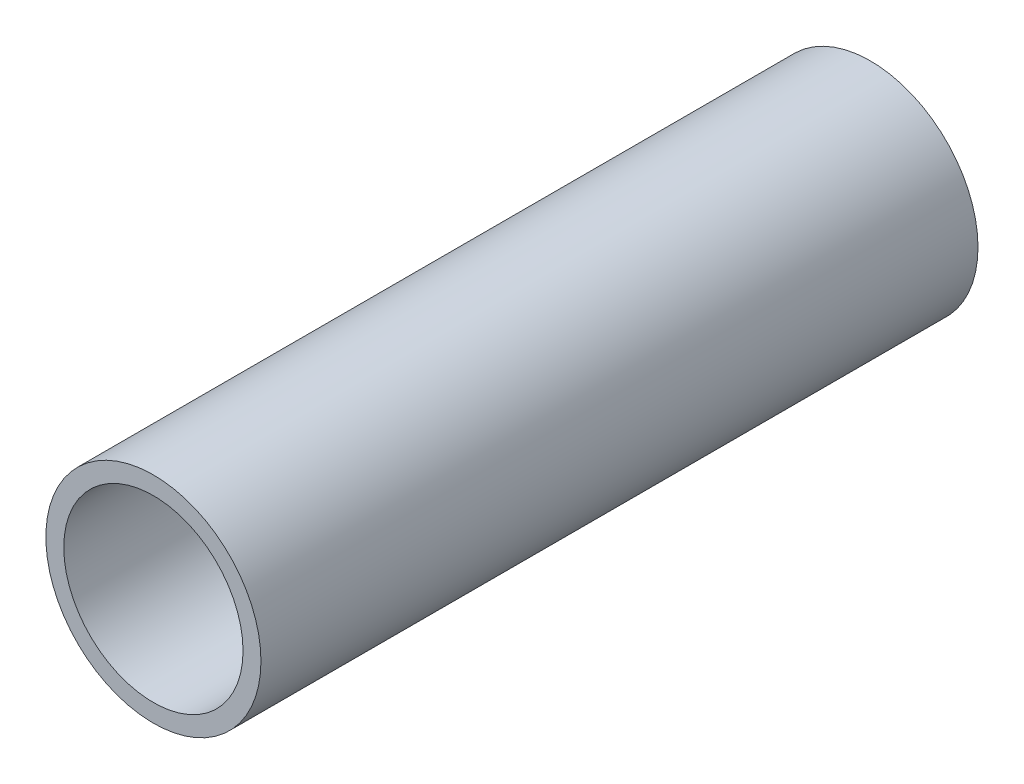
ISO-10303-21;
HEADER;
FILE_DESCRIPTION(('STEP AP214'),'2;1');
FILE_NAME('part.step','',(''),(''),'','','');
FILE_SCHEMA(('AUTOMOTIVE_DESIGN { 1 0 10303 214 1 1 1 1 }'));
ENDSEC;
DATA;
#1=APPLICATION_CONTEXT('core data for automotive mechanical design processes');
#2=APPLICATION_PROTOCOL_DEFINITION('international standard','automotive_design',2000,#1);
#3=PRODUCT_CONTEXT('',#1,'mechanical');
#4=PRODUCT('Part','Part','',(#3));
#5=PRODUCT_RELATED_PRODUCT_CATEGORY('part','',(#4));
#6=PRODUCT_DEFINITION_FORMATION('','',#4);
#7=PRODUCT_DEFINITION_CONTEXT('part definition',#1,'design');
#8=PRODUCT_DEFINITION('design','',#6,#7);
#9=PRODUCT_DEFINITION_SHAPE('','',#8);
#10=(LENGTH_UNIT() NAMED_UNIT(*) SI_UNIT(.MILLI.,.METRE.));
#11=(NAMED_UNIT(*) PLANE_ANGLE_UNIT() SI_UNIT($,.RADIAN.));
#12=(NAMED_UNIT(*) SI_UNIT($,.STERADIAN.) SOLID_ANGLE_UNIT());
#13=UNCERTAINTY_MEASURE_WITH_UNIT(LENGTH_MEASURE(1.E-05),#10,'distance_accuracy_value','');
#14=(GEOMETRIC_REPRESENTATION_CONTEXT(3) GLOBAL_UNCERTAINTY_ASSIGNED_CONTEXT((#13)) GLOBAL_UNIT_ASSIGNED_CONTEXT((#10,
#11,#12)) REPRESENTATION_CONTEXT('',''));
#15=CARTESIAN_POINT('',(0.,0.,0.));
#16=DIRECTION('',(0.,0.,1.));
#17=DIRECTION('',(1.,0.,0.));
#18=AXIS2_PLACEMENT_3D('',#15,#16,#17);
#19=CARTESIAN_POINT('',(-1.11022302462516E-13,0.,20.));
#20=DIRECTION('',(0.,0.,1.));
#21=DIRECTION('',(1.,0.,0.));
#22=AXIS2_PLACEMENT_3D('',#19,#20,#21);
#23=PLANE('',#22);
#24=CARTESIAN_POINT('',(-1.11022302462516E-13,0.,20.));
#25=DIRECTION('',(0.,0.,1.));
#26=DIRECTION('',(1.,0.,0.));
#27=AXIS2_PLACEMENT_3D('',#24,#25,#26);
#28=CIRCLE('',#27,6.);
#29=CARTESIAN_POINT('',(5.99999999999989,0.,20.));
#30=VERTEX_POINT('',#29);
#31=EDGE_CURVE('E10',#30,#30,#28,.T.);
#32=ORIENTED_EDGE('',*,*,#31,.T.);
#33=EDGE_LOOP('',(#32));
#34=FACE_BOUND('',#33,.T.);
#35=CARTESIAN_POINT('',(-1.11022302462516E-13,0.,20.));
#36=DIRECTION('',(0.,0.,1.));
#37=DIRECTION('',(1.,0.,0.));
#38=AXIS2_PLACEMENT_3D('',#35,#36,#37);
#39=CIRCLE('',#38,5.);
#40=CARTESIAN_POINT('',(4.99999999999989,0.,20.));
#41=VERTEX_POINT('',#40);
#42=EDGE_CURVE('E51',#41,#41,#39,.T.);
#43=ORIENTED_EDGE('',*,*,#42,.F.);
#44=EDGE_LOOP('',(#43));
#45=FACE_BOUND('',#44,.T.);
#46=ADVANCED_FACE('F36',(#34,#45),#23,.T.);
#47=CARTESIAN_POINT('',(0.,0.,-20.));
#48=DIRECTION('',(0.,0.,1.));
#49=DIRECTION('',(1.,0.,0.));
#50=AXIS2_PLACEMENT_3D('',#47,#48,#49);
#51=PLANE('',#50);
#52=CARTESIAN_POINT('',(0.,0.,-20.));
#53=DIRECTION('',(0.,0.,1.));
#54=DIRECTION('',(1.,0.,0.));
#55=AXIS2_PLACEMENT_3D('',#52,#53,#54);
#56=CIRCLE('',#55,6.);
#57=CARTESIAN_POINT('',(6.,0.,-20.));
#58=VERTEX_POINT('',#57);
#59=EDGE_CURVE('E44',#58,#58,#56,.T.);
#60=ORIENTED_EDGE('',*,*,#59,.F.);
#61=EDGE_LOOP('',(#60));
#62=FACE_BOUND('',#61,.T.);
#63=CARTESIAN_POINT('',(0.,0.,-20.));
#64=DIRECTION('',(0.,0.,1.));
#65=DIRECTION('',(1.,0.,0.));
#66=AXIS2_PLACEMENT_3D('',#63,#64,#65);
#67=CIRCLE('',#66,5.);
#68=CARTESIAN_POINT('',(5.,0.,-20.));
#69=VERTEX_POINT('',#68);
#70=EDGE_CURVE('E55',#69,#69,#67,.T.);
#71=ORIENTED_EDGE('',*,*,#70,.T.);
#72=EDGE_LOOP('',(#71));
#73=FACE_BOUND('',#72,.T.);
#74=ADVANCED_FACE('F61',(#62,#73),#51,.F.);
#75=CARTESIAN_POINT('',(-1.11022302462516E-13,0.,20.));
#76=DIRECTION('',(0.,0.,-1.));
#77=DIRECTION('',(-1.,0.,0.));
#78=AXIS2_PLACEMENT_3D('',#75,#76,#77);
#79=CYLINDRICAL_SURFACE('',#78,6.);
#80=ORIENTED_EDGE('',*,*,#31,.F.);
#81=EDGE_LOOP('',(#80));
#82=FACE_BOUND('',#81,.T.);
#83=ORIENTED_EDGE('',*,*,#59,.T.);
#84=EDGE_LOOP('',(#83));
#85=FACE_BOUND('',#84,.T.);
#86=ADVANCED_FACE('F38',(#82,#85),#79,.T.);
#87=CARTESIAN_POINT('',(-1.11022302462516E-13,0.,20.));
#88=DIRECTION('',(0.,0.,-1.));
#89=DIRECTION('',(-1.,0.,0.));
#90=AXIS2_PLACEMENT_3D('',#87,#88,#89);
#91=CYLINDRICAL_SURFACE('',#90,5.);
#92=ORIENTED_EDGE('',*,*,#42,.T.);
#93=EDGE_LOOP('',(#92));
#94=FACE_BOUND('',#93,.T.);
#95=ORIENTED_EDGE('',*,*,#70,.F.);
#96=EDGE_LOOP('',(#95));
#97=FACE_BOUND('',#96,.T.);
#98=ADVANCED_FACE('F63',(#94,#97),#91,.F.);
#99=CLOSED_SHELL('',(#46,#74,#86,#98));
#100=MANIFOLD_SOLID_BREP('B2',#99);
#101=ADVANCED_BREP_SHAPE_REPRESENTATION('',(#18,#100),#14);
#102=SHAPE_DEFINITION_REPRESENTATION(#9,#101);
ENDSEC;
END-ISO-10303-21;
